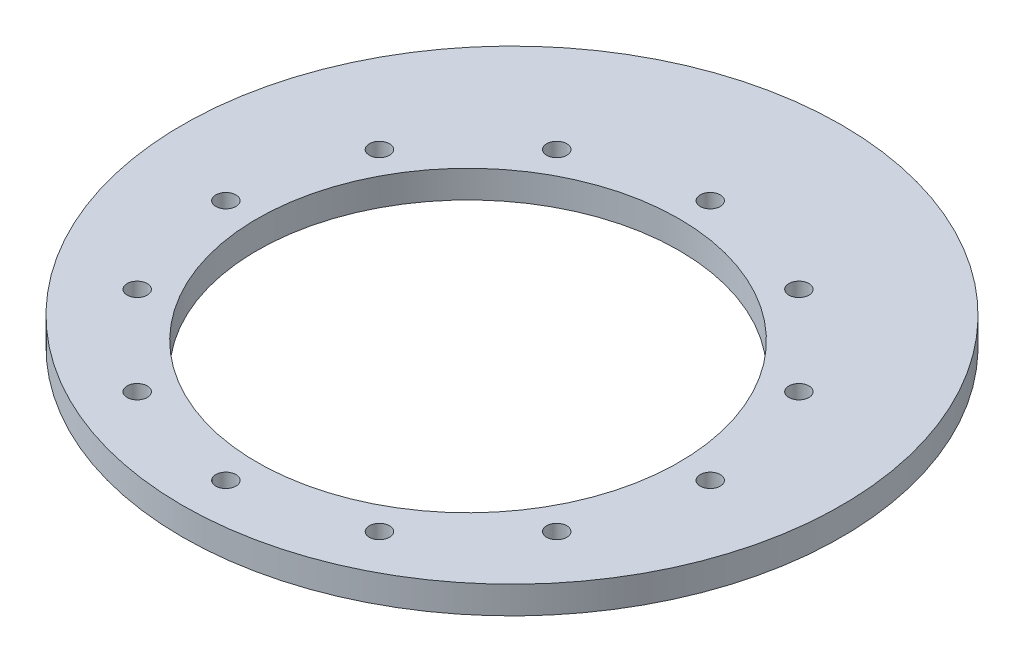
from build123d import *

# Parameters (mm, degrees)
SKETCH1_R         = 114.3
EXTRUDE1_DEPTH    = 9.525
SKETCH2_R         = 3.4905
EXTRUDE2_DEPTH    = 162.925
CIRPATTERN1_COUNT = 12
SKETCH3_R         = 73.175
EXTRUDE3_DEPTH    = 162.925


with BuildPart() as part:
    # Sketch1 → Extrude1 (new body)
    with BuildSketch(Plane(origin=(0, 0, 0), x_dir=(1, 0, 0), z_dir=(0, 1, 0))):
        with Locations(Location((0, 0, 0), (0, 0, 270))):
            Circle(SKETCH1_R)
    extrude(amount=-EXTRUDE1_DEPTH)

    # Sketch2 → Extrude2 (cut, through all)
    with BuildSketch(Plane(origin=(0, -9.525, 0), x_dir=(-1, 0, 0), z_dir=(0, -1, 0))):
        with Locations(Location((0, -99.24, 0), (0, 0, 90))):
            Circle(SKETCH2_R)
    extrude2 = extrude(amount=-EXTRUDE2_DEPTH, mode=Mode.SUBTRACT)

    # CirPattern1: Extrude2 ×12 about axis
    cirpattern1_axis = Axis((0, 0, 15.24), (0, 1, 0))
    for i in range(1, CIRPATTERN1_COUNT):
        add(extrude2.rotate(cirpattern1_axis, i * 360 / CIRPATTERN1_COUNT), mode=Mode.SUBTRACT)

    # Sketch3 → Extrude3 (cut, through all)
    with BuildSketch(Plane(origin=(0, -9.525, 0), x_dir=(-1, 0, 0), z_dir=(0, -1, 0))):
        with Locations(Location((0, -15.24, 0), (0, 0, 90))):
            Circle(SKETCH3_R)
    extrude(amount=-EXTRUDE3_DEPTH, mode=Mode.SUBTRACT)


solid = part.part
